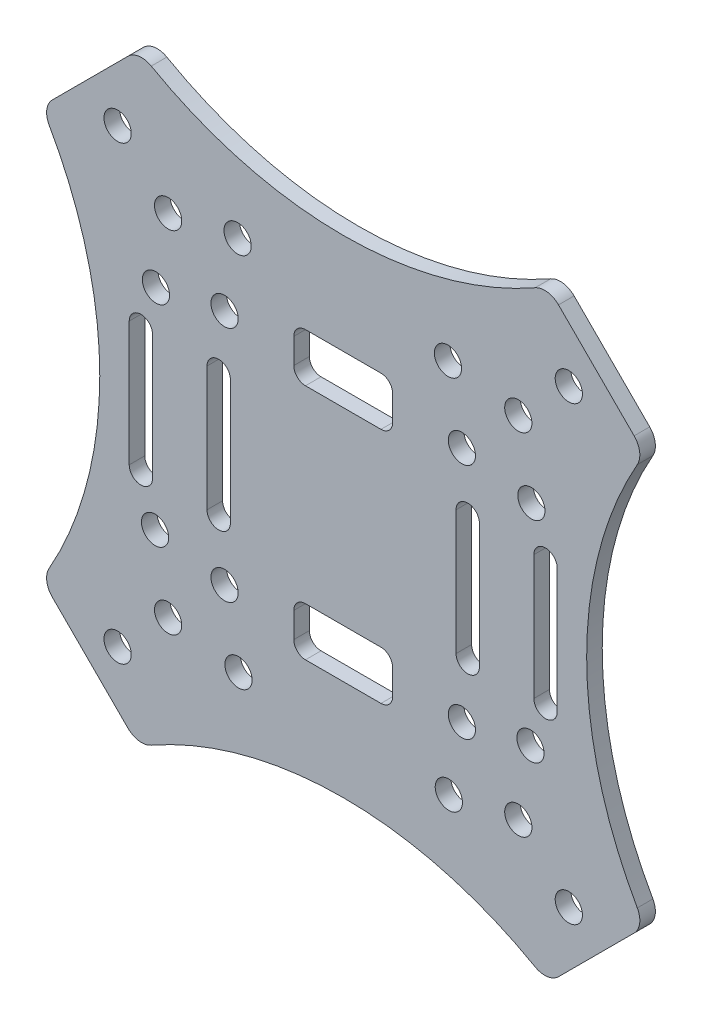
from build123d import *

# Parameters (mm, degrees)
SKETCH3_R           = 1.75
BOSS_EXTRUDE1_DEPTH = 2


with BuildPart() as part:
    # Sketch3 → Boss-Extrude1 (new body)
    with BuildSketch(Plane.XY):
        with BuildLine():
            Line((32.526911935, -32.526911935), (37.385860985, -27.667962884))
            ThreePointArc((37.385860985, -27.667962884), (38.095435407, -26.236022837), (37.792689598, -24.666853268))
            ThreePointArc((37.792689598, -24.666853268), (31.284600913, 0), (37.792689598, 24.666853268))
            ThreePointArc((37.792689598, 24.666853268), (38.095435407, 26.236022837), (37.385860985, 27.667962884))
            Line((37.385860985, 27.667962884), (32.526911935, 32.526911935))
            Line((32.526911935, 32.526911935), (27.667962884, 37.385860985))
            ThreePointArc((27.667962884, 37.385860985), (26.236022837, 38.095435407), (24.666853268, 37.792689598))
            ThreePointArc((24.666853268, 37.792689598), (0, 31.284600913), (-24.666853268, 37.792689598))
            ThreePointArc((-24.666853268, 37.792689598), (-26.236022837, 38.095435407), (-27.667962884, 37.385860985))
            Line((-27.667962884, 37.385860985), (-32.526911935, 32.526911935))
            Line((-32.526911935, 32.526911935), (-37.385860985, 27.667962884))
            ThreePointArc((-37.385860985, 27.667962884), (-38.095435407, 26.236022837), (-37.792689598, 24.666853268))
            ThreePointArc((-37.792689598, 24.666853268), (-31.284600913, 0), (-37.792689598, -24.666853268))
            ThreePointArc((-37.792689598, -24.666853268), (-38.095435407, -26.236022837), (-37.385860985, -27.667962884))
            Line((-37.385860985, -27.667962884), (-32.526911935, -32.526911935))
            Line((-32.526911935, -32.526911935), (-27.667962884, -37.385860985))
            ThreePointArc((-27.667962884, -37.385860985), (-26.236022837, -38.095435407), (-24.666853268, -37.792689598))
            ThreePointArc((-24.666853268, -37.792689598), (0, -31.284600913), (24.666853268, -37.792689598))
            ThreePointArc((24.666853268, -37.792689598), (26.236022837, -38.095435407), (27.667962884, -37.385860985))
            Line((27.667962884, -37.385860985), (32.526911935, -32.526911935))
        make_face()
        with Locations((28.991378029, 28.991378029)):
            Circle(SKETCH3_R, mode=Mode.SUBTRACT)
        with Locations((24.178300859, 13.571699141)):
            Circle(SKETCH3_R, mode=Mode.SUBTRACT)
        with Locations((22.5, 22.5)):
            Circle(SKETCH3_R, mode=Mode.SUBTRACT)
        with Locations((13.460538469, 24.064759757)):
            Circle(SKETCH3_R, mode=Mode.SUBTRACT)
        with Locations((15.25, 15.25)):
            Circle(SKETCH3_R, mode=Mode.SUBTRACT)
        with Locations((-15.25, 15.25)):
            Circle(SKETCH3_R, mode=Mode.SUBTRACT)
        with Locations((-22.5, 22.5)):
            Circle(SKETCH3_R, mode=Mode.SUBTRACT)
        with Locations((-15.25, -15.25)):
            Circle(SKETCH3_R, mode=Mode.SUBTRACT)
        with Locations((15.25, -15.25)):
            Circle(SKETCH3_R, mode=Mode.SUBTRACT)
        with Locations((22.5, -22.5)):
            Circle(SKETCH3_R, mode=Mode.SUBTRACT)
        with Locations((-22.5, -22.5)):
            Circle(SKETCH3_R, mode=Mode.SUBTRACT)
        with Locations((24.064759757, -13.460538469)):
            Circle(SKETCH3_R, mode=Mode.SUBTRACT)
        with Locations((13.571699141, -24.178300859)):
            Circle(SKETCH3_R, mode=Mode.SUBTRACT)
        with Locations((28.991378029, -28.991378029)):
            Circle(SKETCH3_R, mode=Mode.SUBTRACT)
        with Locations((-13.460538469, -24.064759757)):
            Circle(SKETCH3_R, mode=Mode.SUBTRACT)
        with Locations((-24.178300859, -13.571699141)):
            Circle(SKETCH3_R, mode=Mode.SUBTRACT)
        with Locations((-28.991378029, -28.991378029)):
            Circle(SKETCH3_R, mode=Mode.SUBTRACT)
        with Locations((-24.064759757, 13.460538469)):
            Circle(SKETCH3_R, mode=Mode.SUBTRACT)
        with Locations((-13.571699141, 24.178300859)):
            Circle(SKETCH3_R, mode=Mode.SUBTRACT)
        with Locations((-28.991378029, 28.991378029)):
            Circle(SKETCH3_R, mode=Mode.SUBTRACT)
        with BuildLine():
            Line((17.5, 0), (17.5, -8))
            ThreePointArc((17.5, -8), (16, -9.5), (14.5, -8))
            Line((14.5, -8), (14.5, 0))
            Line((14.5, 0), (14.5, 8))
            ThreePointArc((14.5, 8), (16, 9.5), (17.5, 8))
            Line((17.5, 8), (17.5, 0))
        make_face(mode=Mode.SUBTRACT)
        with BuildLine():
            Line((24.5, 0), (24.5, -8))
            ThreePointArc((24.5, -8), (26, -9.5), (27.5, -8))
            Line((27.5, -8), (27.5, 0))
            Line((27.5, 0), (27.5, 8))
            ThreePointArc((27.5, 8), (26, 9.5), (24.5, 8))
            Line((24.5, 8), (24.5, 0))
        make_face(mode=Mode.SUBTRACT)
        with BuildLine():
            Line((-27.5, 0), (-27.5, -8))
            ThreePointArc((-27.5, -8), (-26, -9.5), (-24.5, -8))
            Line((-24.5, -8), (-24.5, 0))
            Line((-24.5, 0), (-24.5, 8))
            ThreePointArc((-24.5, 8), (-26, 9.5), (-27.5, 8))
            Line((-27.5, 8), (-27.5, 0))
        make_face(mode=Mode.SUBTRACT)
        with BuildLine():
            Line((-14.5, 0), (-14.5, 8))
            ThreePointArc((-14.5, 8), (-16, 9.5), (-17.5, 8))
            Line((-17.5, 8), (-17.5, 0))
            Line((-17.5, 0), (-17.5, -8))
            ThreePointArc((-17.5, -8), (-16, -9.5), (-14.5, -8))
            Line((-14.5, -8), (-14.5, 0))
        make_face(mode=Mode.SUBTRACT)
        with BuildLine():
            Line((0, 18.375), (4.85, 18.375))
            ThreePointArc((4.85, 18.375), (5.910660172, 17.935660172), (6.35, 16.875))
            Line((6.35, 16.875), (6.35, 13.625))
            ThreePointArc((6.35, 13.625), (5.910660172, 12.564339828), (4.85, 12.125))
            Line((4.85, 12.125), (0, 12.125))
            Line((0, 12.125), (-4.85, 12.125))
            ThreePointArc((-4.85, 12.125), (-5.910660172, 12.564339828), (-6.35, 13.625))
            Line((-6.35, 13.625), (-6.35, 16.875))
            ThreePointArc((-6.35, 16.875), (-5.910660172, 17.935660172), (-4.85, 18.375))
            Line((-4.85, 18.375), (0, 18.375))
        make_face(mode=Mode.SUBTRACT)
        with BuildLine():
            Line((0, -18.375), (4.85, -18.375))
            ThreePointArc((4.85, -18.375), (5.910660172, -17.935660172), (6.35, -16.875))
            Line((6.35, -16.875), (6.35, -13.625))
            ThreePointArc((6.35, -13.625), (5.910660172, -12.564339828), (4.85, -12.125))
            Line((4.85, -12.125), (0, -12.125))
            Line((0, -12.125), (-4.85, -12.125))
            ThreePointArc((-4.85, -12.125), (-5.910660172, -12.564339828), (-6.35, -13.625))
            Line((-6.35, -13.625), (-6.35, -16.875))
            ThreePointArc((-6.35, -16.875), (-5.910660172, -17.935660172), (-4.85, -18.375))
            Line((-4.85, -18.375), (0, -18.375))
        make_face(mode=Mode.SUBTRACT)
    extrude(amount=BOSS_EXTRUDE1_DEPTH)


solid = part.part
